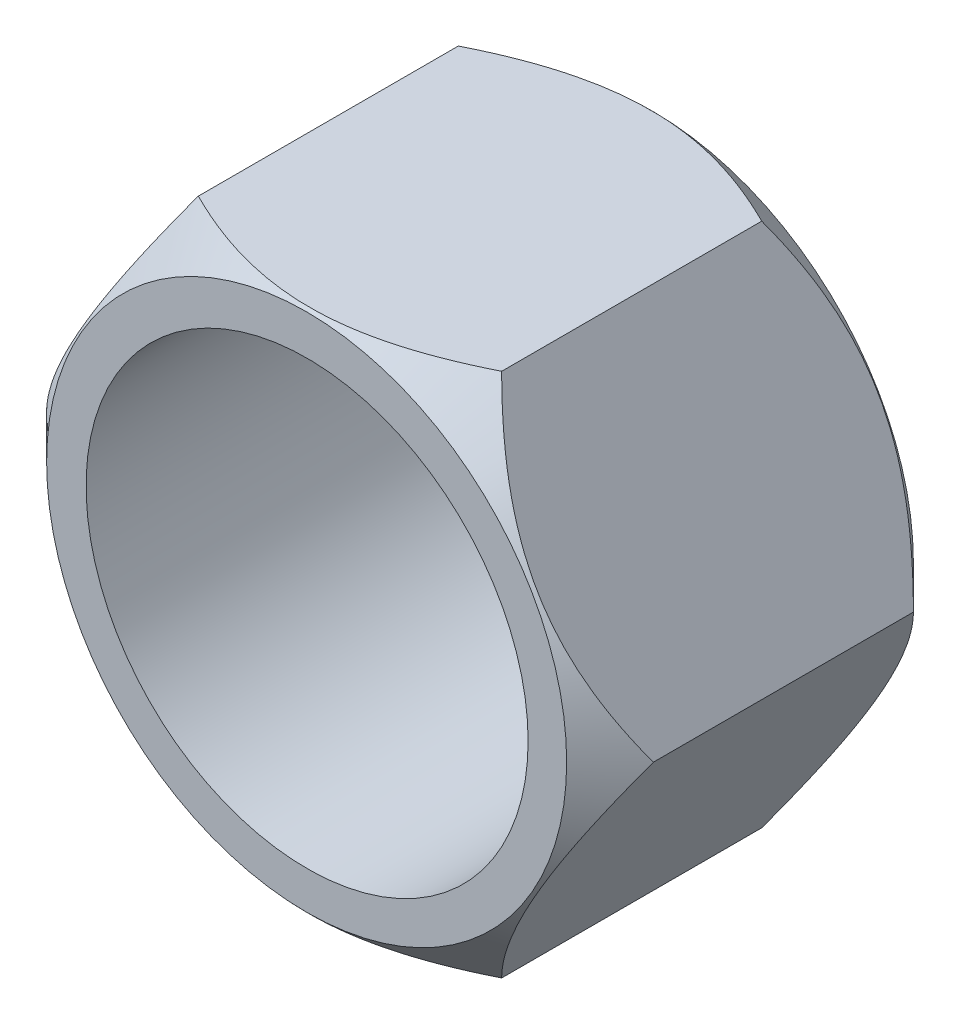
ISO-10303-21;
HEADER;
FILE_DESCRIPTION(('STEP AP214'),'2;1');
FILE_NAME('part.step','',(''),(''),'','','');
FILE_SCHEMA(('AUTOMOTIVE_DESIGN { 1 0 10303 214 1 1 1 1 }'));
ENDSEC;
DATA;
#1=APPLICATION_CONTEXT('core data for automotive mechanical design processes');
#2=APPLICATION_PROTOCOL_DEFINITION('international standard','automotive_design',2000,#1);
#3=PRODUCT_CONTEXT('',#1,'mechanical');
#4=PRODUCT('Part','Part','',(#3));
#5=PRODUCT_RELATED_PRODUCT_CATEGORY('part','',(#4));
#6=PRODUCT_DEFINITION_FORMATION('','',#4);
#7=PRODUCT_DEFINITION_CONTEXT('part definition',#1,'design');
#8=PRODUCT_DEFINITION('design','',#6,#7);
#9=PRODUCT_DEFINITION_SHAPE('','',#8);
#10=(LENGTH_UNIT() NAMED_UNIT(*) SI_UNIT(.MILLI.,.METRE.));
#11=(NAMED_UNIT(*) PLANE_ANGLE_UNIT() SI_UNIT($,.RADIAN.));
#12=(NAMED_UNIT(*) SI_UNIT($,.STERADIAN.) SOLID_ANGLE_UNIT());
#13=UNCERTAINTY_MEASURE_WITH_UNIT(LENGTH_MEASURE(1.E-05),#10,'distance_accuracy_value','');
#14=(GEOMETRIC_REPRESENTATION_CONTEXT(3) GLOBAL_UNCERTAINTY_ASSIGNED_CONTEXT((#13)) GLOBAL_UNIT_ASSIGNED_CONTEXT((#10,
#11,#12)) REPRESENTATION_CONTEXT('',''));
#15=CARTESIAN_POINT('',(0.,0.,0.));
#16=DIRECTION('',(0.,0.,1.));
#17=DIRECTION('',(1.,0.,0.));
#18=AXIS2_PLACEMENT_3D('',#15,#16,#17);
#19=CARTESIAN_POINT('',(0.,0.,3.));
#20=DIRECTION('',(0.,0.,1.));
#21=DIRECTION('',(1.,0.,0.));
#22=AXIS2_PLACEMENT_3D('',#19,#20,#21);
#23=CONICAL_SURFACE('',#22,9.,0.78539816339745);
#24=CARTESIAN_POINT('',(0.,0.,0.));
#25=DIRECTION('',(0.,0.,1.));
#26=DIRECTION('',(1.,0.,0.));
#27=AXIS2_PLACEMENT_3D('',#24,#25,#26);
#28=CIRCLE('',#27,5.99999999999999);
#29=CARTESIAN_POINT('',(5.99999999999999,0.,0.));
#30=VERTEX_POINT('',#29);
#31=EDGE_CURVE('E210',#30,#30,#28,.F.);
#32=ORIENTED_EDGE('',*,*,#31,.F.);
#33=EDGE_LOOP('',(#32));
#34=FACE_BOUND('',#33,.T.);
#35=CARTESIAN_POINT('',(3.49988452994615,6.06237782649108,1.00011547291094));
#36=CARTESIAN_POINT('',(3.56006472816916,5.95814266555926,0.939941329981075));
#37=CARTESIAN_POINT('',(3.62070750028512,5.85310630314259,0.881613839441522));
#38=CARTESIAN_POINT('',(3.74300894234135,5.64127399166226,0.76921390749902));
#39=CARTESIAN_POINT('',(3.80466814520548,5.53447711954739,0.715143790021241));
#40=CARTESIAN_POINT('',(3.99187934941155,5.21021780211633,0.559701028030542));
#41=CARTESIAN_POINT('',(4.1190161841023,4.99001034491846,0.465759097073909));
#42=CARTESIAN_POINT('',(4.37539777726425,4.54594439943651,0.304890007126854));
#43=CARTESIAN_POINT('',(4.5045770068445,4.32219941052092,0.237557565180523));
#44=CARTESIAN_POINT('',(4.70046959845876,3.98290348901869,0.159670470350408));
#45=CARTESIAN_POINT('',(4.76605553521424,3.86930531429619,0.137570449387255));
#46=CARTESIAN_POINT('',(4.89778273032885,3.64114711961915,0.101574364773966));
#47=CARTESIAN_POINT('',(4.96392390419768,3.52658724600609,0.0876770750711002));
#48=CARTESIAN_POINT('',(5.1251007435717,3.24742077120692,0.0643762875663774));
#49=CARTESIAN_POINT('',(5.22031007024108,3.08251338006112,0.0594873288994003));
#50=CARTESIAN_POINT('',(5.41055712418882,2.75299581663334,0.0676930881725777));
#51=CARTESIAN_POINT('',(5.50559477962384,2.58838576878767,0.0807941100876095));
#52=CARTESIAN_POINT('',(5.69477409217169,2.26071758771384,0.124207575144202));
#53=CARTESIAN_POINT('',(5.78891462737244,2.09766139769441,0.154539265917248));
#54=CARTESIAN_POINT('',(5.97557765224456,1.77435155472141,0.230765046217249));
#55=CARTESIAN_POINT('',(6.06810026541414,1.61409768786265,0.276657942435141));
#56=CARTESIAN_POINT('',(6.2323446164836,1.32961812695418,0.371073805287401));
#57=CARTESIAN_POINT('',(6.30443003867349,1.20476251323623,0.417113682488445));
#58=CARTESIAN_POINT('',(6.447306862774,0.957292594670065,0.516612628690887));
#59=CARTESIAN_POINT('',(6.51809822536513,0.834678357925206,0.570071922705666));
#60=CARTESIAN_POINT('',(6.65816396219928,0.592077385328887,0.68321133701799));
#61=CARTESIAN_POINT('',(6.72744231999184,0.472083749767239,0.742871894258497));
#62=CARTESIAN_POINT('',(6.86471619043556,0.23431843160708,0.867630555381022));
#63=CARTESIAN_POINT('',(6.93271245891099,0.116545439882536,0.932725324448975));
#64=CARTESIAN_POINT('',(7.00011547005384,-0.000200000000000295,1.00011547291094));
#65=B_SPLINE_CURVE_WITH_KNOTS('',3,(#35,#36,#37,#38,#39,#40,#41,#42,#43,#44,#45,#46,#47,#48,#49,
#50,#51,#52,#53,#54,#55,#56,#57,#58,#59,#60,#61,#62,#63,#64),.UNSPECIFIED.,.F.,.F.,(4,2,2,2,2,2,
2,2,2,2,2,2,2,2,4),(0.,0.403669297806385,0.807557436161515,1.61969420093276,2.41893497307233,
2.81777152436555,3.21654844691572,3.78710477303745,4.35786108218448,4.92925621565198,
5.50060754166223,5.95442549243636,6.40825720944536,6.8606983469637,7.31286384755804),.UNSPECIFIED.);
#66=CARTESIAN_POINT('',(3.49999999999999,6.06217782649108,1.00000000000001));
#67=VERTEX_POINT('',#66);
#68=CARTESIAN_POINT('',(7.,0.,1.00000000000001));
#69=VERTEX_POINT('',#68);
#70=EDGE_CURVE('E87',#67,#69,#65,.T.);
#71=ORIENTED_EDGE('',*,*,#70,.T.);
#72=CARTESIAN_POINT('',(7.00011547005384,0.0002,1.00011547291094));
#73=CARTESIAN_POINT('',(6.93993527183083,-0.104035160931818,0.939941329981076));
#74=CARTESIAN_POINT('',(6.87929249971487,-0.209071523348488,0.881613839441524));
#75=CARTESIAN_POINT('',(6.75699105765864,-0.42090383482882,0.769213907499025));
#76=CARTESIAN_POINT('',(6.69533185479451,-0.527700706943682,0.715143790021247));
#77=CARTESIAN_POINT('',(6.50812065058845,-0.851960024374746,0.559701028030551));
#78=CARTESIAN_POINT('',(6.3809838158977,-1.07216748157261,0.465759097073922));
#79=CARTESIAN_POINT('',(6.12460222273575,-1.51623342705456,0.304890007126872));
#80=CARTESIAN_POINT('',(5.99542299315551,-1.73997841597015,0.237557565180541));
#81=CARTESIAN_POINT('',(5.79953040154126,-2.07927433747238,0.159670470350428));
#82=CARTESIAN_POINT('',(5.73394446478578,-2.19287251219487,0.137570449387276));
#83=CARTESIAN_POINT('',(5.60221726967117,-2.42103070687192,0.10157436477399));
#84=CARTESIAN_POINT('',(5.53607609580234,-2.53559058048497,0.0876770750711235));
#85=CARTESIAN_POINT('',(5.37489925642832,-2.81475705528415,0.0643762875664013));
#86=CARTESIAN_POINT('',(5.27968992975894,-2.97966444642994,0.059487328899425));
#87=CARTESIAN_POINT('',(5.0894428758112,-3.30918200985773,0.0676930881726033));
#88=CARTESIAN_POINT('',(4.99440522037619,-3.4737920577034,0.0807941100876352));
#89=CARTESIAN_POINT('',(4.80522590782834,-3.80146023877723,0.124207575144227));
#90=CARTESIAN_POINT('',(4.71108537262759,-3.96451642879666,0.154539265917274));
#91=CARTESIAN_POINT('',(4.52442234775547,-4.28782627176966,0.230765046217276));
#92=CARTESIAN_POINT('',(4.43189973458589,-4.44808013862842,0.276657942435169));
#93=CARTESIAN_POINT('',(4.26765538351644,-4.73255969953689,0.371073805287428));
#94=CARTESIAN_POINT('',(4.19556996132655,-4.85741531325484,0.41711368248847));
#95=CARTESIAN_POINT('',(4.05269313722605,-5.10488523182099,0.516612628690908));
#96=CARTESIAN_POINT('',(3.98190177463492,-5.22749946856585,0.570071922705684));
#97=CARTESIAN_POINT('',(3.84183603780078,-5.47010044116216,0.683211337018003));
#98=CARTESIAN_POINT('',(3.77255768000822,-5.5900940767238,0.742871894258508));
#99=CARTESIAN_POINT('',(3.63528380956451,-5.82785939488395,0.867630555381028));
#100=CARTESIAN_POINT('',(3.56728754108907,-5.9456323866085,0.932725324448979));
#101=CARTESIAN_POINT('',(3.49988452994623,-6.06237782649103,1.00011547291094));
#102=B_SPLINE_CURVE_WITH_KNOTS('',3,(#72,#73,#74,#75,#76,#77,#78,#79,#80,#81,#82,#83,#84,#85,
#86,#87,#88,#89,#90,#91,#92,#93,#94,#95,#96,#97,#98,#99,#100,#101),.UNSPECIFIED.,.F.,.F.,(4,2,2,
2,2,2,2,2,2,2,2,2,2,2,4),(0.,0.403669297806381,0.807557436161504,1.61969420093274,
2.4189349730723,2.81777152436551,3.21654844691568,3.78710477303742,4.35786108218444,
4.92925621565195,5.5006075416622,5.95442549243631,6.40825720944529,6.86069834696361,
7.31286384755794),.UNSPECIFIED.);
#103=CARTESIAN_POINT('',(3.50000000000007,-6.06217782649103,1.00000000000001));
#104=VERTEX_POINT('',#103);
#105=EDGE_CURVE('E176',#69,#104,#102,.T.);
#106=ORIENTED_EDGE('',*,*,#105,.T.);
#107=CARTESIAN_POINT('',(-7.4821683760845,-6.06217782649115,3.62978938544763));
#108=CARTESIAN_POINT('',(-7.30206749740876,-6.06217782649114,3.48988550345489));
#109=CARTESIAN_POINT('',(-7.12101670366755,-6.06217782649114,3.35118561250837));
#110=CARTESIAN_POINT('',(-6.75661990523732,-6.06217782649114,3.07674964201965));
#111=CARTESIAN_POINT('',(-6.57327338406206,-6.06217782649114,2.94101424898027));
#112=CARTESIAN_POINT('',(-6.20255269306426,-6.06217782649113,2.67209823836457));
#113=CARTESIAN_POINT('',(-6.01515839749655,-6.06217782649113,2.53894527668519));
#114=CARTESIAN_POINT('',(-5.63728718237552,-6.06217782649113,2.27710324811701));
#115=CARTESIAN_POINT('',(-5.44681047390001,-6.06217782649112,2.14841387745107));
#116=CARTESIAN_POINT('',(-5.04937814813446,-6.06217782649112,1.88810316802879));
#117=CARTESIAN_POINT('',(-4.84217255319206,-6.06217782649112,1.75686158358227));
#118=CARTESIAN_POINT('',(-4.42288563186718,-6.06217782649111,1.50227676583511));
#119=CARTESIAN_POINT('',(-4.21080346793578,-6.06217782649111,1.37893490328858));
#120=CARTESIAN_POINT('',(-3.78166384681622,-6.06217782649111,1.14275692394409));
#121=CARTESIAN_POINT('',(-3.56462346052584,-6.0621778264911,1.02989003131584));
#122=CARTESIAN_POINT('',(-3.12429710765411,-6.0621778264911,0.817191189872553));
#123=CARTESIAN_POINT('',(-2.90101421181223,-6.0621778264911,0.717352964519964));
#124=CARTESIAN_POINT('',(-2.47206356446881,-6.06217782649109,0.544225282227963));
#125=CARTESIAN_POINT('',(-2.26708951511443,-6.06217782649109,0.469234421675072));
#126=CARTESIAN_POINT('',(-1.85176699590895,-6.06217782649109,0.335646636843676));
#127=CARTESIAN_POINT('',(-1.64141819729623,-6.06217782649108,0.277050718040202));
#128=CARTESIAN_POINT('',(-1.22035981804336,-6.06217782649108,0.180467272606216));
#129=CARTESIAN_POINT('',(-1.00974034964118,-6.06217782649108,0.142093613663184));
#130=CARTESIAN_POINT('',(-0.585689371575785,-6.06217782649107,0.0867818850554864));
#131=CARTESIAN_POINT('',(-0.372258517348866,-6.06217782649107,0.0698389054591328));
#132=CARTESIAN_POINT('',(0.0449016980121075,-6.06217782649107,0.0589309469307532));
#133=CARTESIAN_POINT('',(0.248603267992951,-6.06217782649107,0.0638986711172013));
#134=CARTESIAN_POINT('',(0.654494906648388,-6.06217782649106,0.0940446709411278));
#135=CARTESIAN_POINT('',(0.856684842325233,-6.06217782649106,0.11922470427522));
#136=CARTESIAN_POINT('',(1.26152367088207,-6.06217782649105,0.188772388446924));
#137=CARTESIAN_POINT('',(1.46411214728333,-6.06217782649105,0.233485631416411));
#138=CARTESIAN_POINT('',(1.86479717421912,-6.06217782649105,0.339566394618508));
#139=CARTESIAN_POINT('',(2.06289391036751,-6.06217782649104,0.400933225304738));
#140=CARTESIAN_POINT('',(2.46214896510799,-6.06217782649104,0.54031691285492));
#141=CARTESIAN_POINT('',(2.66310376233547,-6.06217782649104,0.618909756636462));
#142=CARTESIAN_POINT('',(3.05986341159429,-6.06217782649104,0.788265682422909));
#143=CARTESIAN_POINT('',(3.25566592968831,-6.06217782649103,0.879034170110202));
#144=CARTESIAN_POINT('',(3.64303244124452,-6.06217782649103,1.07059087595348));
#145=CARTESIAN_POINT('',(3.83458119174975,-6.06217782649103,1.17140966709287));
#146=CARTESIAN_POINT('',(4.21329670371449,-6.06217782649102,1.38085265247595));
#147=CARTESIAN_POINT('',(4.40046412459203,-6.06217782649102,1.48947566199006));
#148=CARTESIAN_POINT('',(4.76185682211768,-6.06217782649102,1.70750006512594));
#149=CARTESIAN_POINT('',(4.93626535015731,-6.06217782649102,1.81659931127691));
#150=CARTESIAN_POINT('',(5.28208532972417,-6.06217782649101,2.0394623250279));
#151=CARTESIAN_POINT('',(5.45349655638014,-6.06217782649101,2.15322644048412));
#152=CARTESIAN_POINT('',(5.79234143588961,-6.06217782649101,2.38366781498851));
#153=CARTESIAN_POINT('',(5.95979592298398,-6.062177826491,2.5003145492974));
#154=CARTESIAN_POINT('',(6.29240454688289,-6.062177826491,2.73675063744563));
#155=CARTESIAN_POINT('',(6.45755930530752,-6.062177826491,2.85653911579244));
#156=CARTESIAN_POINT('',(6.62174871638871,-6.062177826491,2.9776141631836));
#157=B_SPLINE_CURVE_WITH_KNOTS('',3,(#107,#108,#109,#110,#111,#112,#113,#114,#115,#116,#117,
#118,#119,#120,#121,#122,#123,#124,#125,#126,#127,#128,#129,#130,#131,#132,#133,#134,#135,#136,
#137,#138,#139,#140,#141,#142,#143,#144,#145,#146,#147,#148,#149,#150,#151,#152,#153,#154,#155,
#156),.UNSPECIFIED.,.F.,.F.,(4,2,2,2,2,2,2,2,2,2,2,2,2,2,2,2,2,2,2,2,2,2,2,2,4),(0.,
0.684179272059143,1.36851533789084,2.05811141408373,2.74766046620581,3.48333743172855,
4.21914170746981,4.95271077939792,5.68592514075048,6.34014994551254,6.99441486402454,
7.63568747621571,8.27681314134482,8.8870629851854,9.49736590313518,10.1189339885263,
10.7404763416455,11.3873146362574,12.0344410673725,12.683599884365,13.3326603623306,
13.9497353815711,14.5668564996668,15.1790486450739,15.7910719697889),.UNSPECIFIED.);
#158=CARTESIAN_POINT('',(-3.49999999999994,-6.0621778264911,1.00000000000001));
#159=VERTEX_POINT('',#158);
#160=EDGE_CURVE('E170',#104,#159,#157,.F.);
#161=ORIENTED_EDGE('',*,*,#160,.T.);
#162=CARTESIAN_POINT('',(-3.4998845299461,-6.0623778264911,1.00011547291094));
#163=CARTESIAN_POINT('',(-3.56006472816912,-5.95814266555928,0.939941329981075));
#164=CARTESIAN_POINT('',(-3.62070750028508,-5.85310630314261,0.881613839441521));
#165=CARTESIAN_POINT('',(-3.74300894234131,-5.64127399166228,0.769213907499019));
#166=CARTESIAN_POINT('',(-3.80466814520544,-5.53447711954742,0.71514379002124));
#167=CARTESIAN_POINT('',(-3.99187934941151,-5.21021780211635,0.559701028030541));
#168=CARTESIAN_POINT('',(-4.11901618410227,-4.99001034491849,0.465759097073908));
#169=CARTESIAN_POINT('',(-4.37539777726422,-4.54594439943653,0.304890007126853));
#170=CARTESIAN_POINT('',(-4.50457700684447,-4.32219941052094,0.237557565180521));
#171=CARTESIAN_POINT('',(-4.70046959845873,-3.98290348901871,0.159670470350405));
#172=CARTESIAN_POINT('',(-4.76605553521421,-3.86930531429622,0.137570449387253));
#173=CARTESIAN_POINT('',(-4.89778273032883,-3.64114711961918,0.101574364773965));
#174=CARTESIAN_POINT('',(-4.96392390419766,-3.52658724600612,0.0876770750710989));
#175=CARTESIAN_POINT('',(-5.12510074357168,-3.24742077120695,0.0643762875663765));
#176=CARTESIAN_POINT('',(-5.22031007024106,-3.08251338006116,0.0594873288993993));
#177=CARTESIAN_POINT('',(-5.41055712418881,-2.75299581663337,0.0676930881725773));
#178=CARTESIAN_POINT('',(-5.50559477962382,-2.5883857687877,0.0807941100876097));
#179=CARTESIAN_POINT('',(-5.69477409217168,-2.26071758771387,0.124207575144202));
#180=CARTESIAN_POINT('',(-5.78891462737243,-2.09766139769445,0.154539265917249));
#181=CARTESIAN_POINT('',(-5.97557765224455,-1.77435155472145,0.230765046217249));
#182=CARTESIAN_POINT('',(-6.06810026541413,-1.61409768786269,0.276657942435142));
#183=CARTESIAN_POINT('',(-6.23234461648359,-1.32961812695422,0.371073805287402));
#184=CARTESIAN_POINT('',(-6.30443003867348,-1.20476251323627,0.417113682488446));
#185=CARTESIAN_POINT('',(-6.447306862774,-0.957292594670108,0.516612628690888));
#186=CARTESIAN_POINT('',(-6.51809822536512,-0.834678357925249,0.570071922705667));
#187=CARTESIAN_POINT('',(-6.65816396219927,-0.592077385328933,0.683211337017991));
#188=CARTESIAN_POINT('',(-6.72744231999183,-0.472083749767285,0.742871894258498));
#189=CARTESIAN_POINT('',(-6.86471619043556,-0.234318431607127,0.867630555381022));
#190=CARTESIAN_POINT('',(-6.93271245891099,-0.116545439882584,0.932725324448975));
#191=CARTESIAN_POINT('',(-7.00011547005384,0.000199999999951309,1.00011547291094));
#192=B_SPLINE_CURVE_WITH_KNOTS('',3,(#162,#163,#164,#165,#166,#167,#168,#169,#170,#171,#172,
#173,#174,#175,#176,#177,#178,#179,#180,#181,#182,#183,#184,#185,#186,#187,#188,#189,#190,#191),
.UNSPECIFIED.,.F.,.F.,(4,2,2,2,2,2,2,2,2,2,2,2,2,2,4),(0.,0.403669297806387,0.807557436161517,
1.61969420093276,2.41893497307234,2.81777152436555,3.21654844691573,3.78710477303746,
4.35786108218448,4.92925621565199,5.50060754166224,5.95442549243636,6.40825720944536,
6.8606983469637,7.31286384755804),.UNSPECIFIED.);
#193=CARTESIAN_POINT('',(-7.,0.,1.00000000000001));
#194=VERTEX_POINT('',#193);
#195=EDGE_CURVE('E108',#159,#194,#192,.T.);
#196=ORIENTED_EDGE('',*,*,#195,.T.);
#197=CARTESIAN_POINT('',(-7.00011547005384,-0.000200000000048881,1.00011547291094));
#198=CARTESIAN_POINT('',(-6.93993527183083,0.104035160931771,0.939941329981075));
#199=CARTESIAN_POINT('',(-6.87929249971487,0.209071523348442,0.881613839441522));
#200=CARTESIAN_POINT('',(-6.75699105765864,0.420903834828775,0.769213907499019));
#201=CARTESIAN_POINT('',(-6.69533185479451,0.527700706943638,0.71514379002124));
#202=CARTESIAN_POINT('',(-6.50812065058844,0.851960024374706,0.55970102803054));
#203=CARTESIAN_POINT('',(-6.38098381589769,1.07216748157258,0.465759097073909));
#204=CARTESIAN_POINT('',(-6.12460222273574,1.51623342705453,0.304890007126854));
#205=CARTESIAN_POINT('',(-5.9954229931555,1.73997841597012,0.237557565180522));
#206=CARTESIAN_POINT('',(-5.79953040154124,2.07927433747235,0.159670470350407));
#207=CARTESIAN_POINT('',(-5.73394446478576,2.19287251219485,0.137570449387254));
#208=CARTESIAN_POINT('',(-5.60221726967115,2.4210307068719,0.101574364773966));
#209=CARTESIAN_POINT('',(-5.53607609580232,2.53559058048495,0.0876770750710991));
#210=CARTESIAN_POINT('',(-5.3748992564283,2.81475705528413,0.0643762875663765));
#211=CARTESIAN_POINT('',(-5.27968992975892,2.97966444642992,0.0594873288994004));
#212=CARTESIAN_POINT('',(-5.08944287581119,3.3091820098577,0.0676930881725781));
#213=CARTESIAN_POINT('',(-4.99440522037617,3.47379205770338,0.0807941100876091));
#214=CARTESIAN_POINT('',(-4.80522590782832,3.80146023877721,0.124207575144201));
#215=CARTESIAN_POINT('',(-4.71108537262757,3.96451642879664,0.154539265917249));
#216=CARTESIAN_POINT('',(-4.52442234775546,4.28782627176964,0.23076504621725));
#217=CARTESIAN_POINT('',(-4.43189973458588,4.44808013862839,0.276657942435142));
#218=CARTESIAN_POINT('',(-4.26765538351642,4.73255969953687,0.371073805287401));
#219=CARTESIAN_POINT('',(-4.19556996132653,4.85741531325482,0.417113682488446));
#220=CARTESIAN_POINT('',(-4.05269313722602,5.10488523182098,0.516612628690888));
#221=CARTESIAN_POINT('',(-3.9819017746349,5.22749946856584,0.570071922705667));
#222=CARTESIAN_POINT('',(-3.84183603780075,5.47010044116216,0.68321133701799));
#223=CARTESIAN_POINT('',(-3.77255768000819,5.59009407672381,0.742871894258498));
#224=CARTESIAN_POINT('',(-3.63528380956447,5.82785939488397,0.867630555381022));
#225=CARTESIAN_POINT('',(-3.56728754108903,5.94563238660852,0.932725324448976));
#226=CARTESIAN_POINT('',(-3.49988452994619,6.06237782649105,1.00011547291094));
#227=B_SPLINE_CURVE_WITH_KNOTS('',3,(#197,#198,#199,#200,#201,#202,#203,#204,#205,#206,#207,
#208,#209,#210,#211,#212,#213,#214,#215,#216,#217,#218,#219,#220,#221,#222,#223,#224,#225,#226),
.UNSPECIFIED.,.F.,.F.,(4,2,2,2,2,2,2,2,2,2,2,2,2,2,4),(0.,0.403669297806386,0.807557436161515,
1.61969420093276,2.41893497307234,2.81777152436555,3.21654844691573,3.78710477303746,
4.35786108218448,4.92925621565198,5.50060754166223,5.95442549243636,6.40825720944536,
6.8606983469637,7.31286384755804),.UNSPECIFIED.);
#228=CARTESIAN_POINT('',(-3.50000000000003,6.06217782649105,1.00000000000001));
#229=VERTEX_POINT('',#228);
#230=EDGE_CURVE('E106',#194,#229,#227,.T.);
#231=ORIENTED_EDGE('',*,*,#230,.T.);
#232=CARTESIAN_POINT('',(-7.48216837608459,6.06217782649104,3.62978938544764));
#233=CARTESIAN_POINT('',(-7.30206749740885,6.06217782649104,3.48988550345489));
#234=CARTESIAN_POINT('',(-7.12101670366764,6.06217782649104,3.35118561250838));
#235=CARTESIAN_POINT('',(-6.75661990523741,6.06217782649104,3.07674964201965));
#236=CARTESIAN_POINT('',(-6.57327338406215,6.06217782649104,2.94101424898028));
#237=CARTESIAN_POINT('',(-6.20255269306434,6.06217782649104,2.67209823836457));
#238=CARTESIAN_POINT('',(-6.01515839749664,6.06217782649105,2.53894527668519));
#239=CARTESIAN_POINT('',(-5.63728718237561,6.06217782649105,2.27710324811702));
#240=CARTESIAN_POINT('',(-5.4468104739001,6.06217782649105,2.14841387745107));
#241=CARTESIAN_POINT('',(-5.04937814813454,6.06217782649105,1.88810316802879));
#242=CARTESIAN_POINT('',(-4.84217255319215,6.06217782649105,1.75686158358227));
#243=CARTESIAN_POINT('',(-4.42288563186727,6.06217782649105,1.50227676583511));
#244=CARTESIAN_POINT('',(-4.21080346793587,6.06217782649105,1.37893490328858));
#245=CARTESIAN_POINT('',(-3.78166384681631,6.06217782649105,1.14275692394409));
#246=CARTESIAN_POINT('',(-3.56462346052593,6.06217782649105,1.02989003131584));
#247=CARTESIAN_POINT('',(-3.1242971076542,6.06217782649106,0.817191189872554));
#248=CARTESIAN_POINT('',(-2.90101421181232,6.06217782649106,0.717352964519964));
#249=CARTESIAN_POINT('',(-2.4720635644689,6.06217782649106,0.544225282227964));
#250=CARTESIAN_POINT('',(-2.26708951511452,6.06217782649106,0.469234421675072));
#251=CARTESIAN_POINT('',(-1.85176699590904,6.06217782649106,0.335646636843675));
#252=CARTESIAN_POINT('',(-1.64141819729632,6.06217782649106,0.277050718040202));
#253=CARTESIAN_POINT('',(-1.22035981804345,6.06217782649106,0.180467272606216));
#254=CARTESIAN_POINT('',(-1.00974034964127,6.06217782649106,0.142093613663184));
#255=CARTESIAN_POINT('',(-0.585689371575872,6.06217782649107,0.086781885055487));
#256=CARTESIAN_POINT('',(-0.372258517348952,6.06217782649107,0.0698389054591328));
#257=CARTESIAN_POINT('',(0.0449016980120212,6.06217782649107,0.0589309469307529));
#258=CARTESIAN_POINT('',(0.248603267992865,6.06217782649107,0.0638986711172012));
#259=CARTESIAN_POINT('',(0.654494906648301,6.06217782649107,0.0940446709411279));
#260=CARTESIAN_POINT('',(0.856684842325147,6.06217782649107,0.11922470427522));
#261=CARTESIAN_POINT('',(1.26152367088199,6.06217782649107,0.188772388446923));
#262=CARTESIAN_POINT('',(1.46411214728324,6.06217782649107,0.233485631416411));
#263=CARTESIAN_POINT('',(1.86479717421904,6.06217782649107,0.339566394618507));
#264=CARTESIAN_POINT('',(2.06289391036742,6.06217782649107,0.400933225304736));
#265=CARTESIAN_POINT('',(2.46214896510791,6.06217782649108,0.540316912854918));
#266=CARTESIAN_POINT('',(2.66310376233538,6.06217782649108,0.618909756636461));
#267=CARTESIAN_POINT('',(3.0598634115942,6.06217782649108,0.788265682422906));
#268=CARTESIAN_POINT('',(3.25566592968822,6.06217782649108,0.879034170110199));
#269=CARTESIAN_POINT('',(3.64303244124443,6.06217782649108,1.07059087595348));
#270=CARTESIAN_POINT('',(3.83458119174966,6.06217782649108,1.17140966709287));
#271=CARTESIAN_POINT('',(4.2132967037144,6.06217782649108,1.38085265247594));
#272=CARTESIAN_POINT('',(4.40046412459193,6.06217782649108,1.48947566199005));
#273=CARTESIAN_POINT('',(4.76185682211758,6.06217782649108,1.70750006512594));
#274=CARTESIAN_POINT('',(4.93626535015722,6.06217782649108,1.81659931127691));
#275=CARTESIAN_POINT('',(5.28208532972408,6.06217782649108,2.03946232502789));
#276=CARTESIAN_POINT('',(5.45349655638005,6.06217782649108,2.15322644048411));
#277=CARTESIAN_POINT('',(5.79234143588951,6.06217782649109,2.38366781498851));
#278=CARTESIAN_POINT('',(5.95979592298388,6.06217782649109,2.50031454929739));
#279=CARTESIAN_POINT('',(6.2924045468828,6.06217782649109,2.73675063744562));
#280=CARTESIAN_POINT('',(6.45755930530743,6.06217782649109,2.85653911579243));
#281=CARTESIAN_POINT('',(6.62174871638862,6.06217782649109,2.97761416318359));
#282=B_SPLINE_CURVE_WITH_KNOTS('',3,(#232,#233,#234,#235,#236,#237,#238,#239,#240,#241,#242,
#243,#244,#245,#246,#247,#248,#249,#250,#251,#252,#253,#254,#255,#256,#257,#258,#259,#260,#261,
#262,#263,#264,#265,#266,#267,#268,#269,#270,#271,#272,#273,#274,#275,#276,#277,#278,#279,#280,
#281),.UNSPECIFIED.,.F.,.F.,(4,2,2,2,2,2,2,2,2,2,2,2,2,2,2,2,2,2,2,2,2,2,2,2,4),(0.,
0.684179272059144,1.36851533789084,2.05811141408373,2.74766046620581,3.48333743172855,
4.21914170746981,4.95271077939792,5.68592514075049,6.34014994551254,6.99441486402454,
7.63568747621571,8.27681314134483,8.88706298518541,9.49736590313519,10.1189339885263,
10.7404763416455,11.3873146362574,12.0344410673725,12.683599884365,13.3326603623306,
13.9497353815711,14.5668564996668,15.1790486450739,15.7910719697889),.UNSPECIFIED.);
#283=EDGE_CURVE('E92',#229,#67,#282,.T.);
#284=ORIENTED_EDGE('',*,*,#283,.T.);
#285=EDGE_LOOP('',(#71,#106,#161,#196,#231,#284));
#286=FACE_BOUND('',#285,.T.);
#287=ADVANCED_FACE('F32',(#34,#286),#23,.T.);
#288=CARTESIAN_POINT('',(0.,0.,8.));
#289=DIRECTION('',(0.,0.,-1.));
#290=DIRECTION('',(-1.,0.,0.));
#291=AXIS2_PLACEMENT_3D('',#288,#289,#290);
#292=CONICAL_SURFACE('',#291,6.00000000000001,0.785398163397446);
#293=CARTESIAN_POINT('',(0.,0.,8.));
#294=DIRECTION('',(0.,0.,1.));
#295=DIRECTION('',(1.,0.,0.));
#296=AXIS2_PLACEMENT_3D('',#293,#294,#295);
#297=CIRCLE('',#296,6.00000000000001);
#298=CARTESIAN_POINT('',(6.00000000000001,0.,8.));
#299=VERTEX_POINT('',#298);
#300=EDGE_CURVE('E211',#299,#299,#297,.T.);
#301=ORIENTED_EDGE('',*,*,#300,.F.);
#302=EDGE_LOOP('',(#301));
#303=FACE_BOUND('',#302,.T.);
#304=CARTESIAN_POINT('',(-7.48216837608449,-6.06217782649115,4.37021061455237));
#305=CARTESIAN_POINT('',(-7.30206749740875,-6.06217782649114,4.51011449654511));
#306=CARTESIAN_POINT('',(-7.12101670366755,-6.06217782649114,4.64881438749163));
#307=CARTESIAN_POINT('',(-6.75661990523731,-6.06217782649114,4.92325035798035));
#308=CARTESIAN_POINT('',(-6.57327338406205,-6.06217782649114,5.05898575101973));
#309=CARTESIAN_POINT('',(-6.20255269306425,-6.06217782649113,5.32790176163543));
#310=CARTESIAN_POINT('',(-6.01515839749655,-6.06217782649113,5.46105472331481));
#311=CARTESIAN_POINT('',(-5.63728718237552,-6.06217782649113,5.72289675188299));
#312=CARTESIAN_POINT('',(-5.44681047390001,-6.06217782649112,5.85158612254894));
#313=CARTESIAN_POINT('',(-5.04937814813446,-6.06217782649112,6.11189683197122));
#314=CARTESIAN_POINT('',(-4.84217255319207,-6.06217782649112,6.24313841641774));
#315=CARTESIAN_POINT('',(-4.42288563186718,-6.06217782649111,6.4977232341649));
#316=CARTESIAN_POINT('',(-4.21080346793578,-6.06217782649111,6.62106509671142));
#317=CARTESIAN_POINT('',(-3.78166384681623,-6.06217782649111,6.85724307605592));
#318=CARTESIAN_POINT('',(-3.56462346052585,-6.0621778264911,6.97010996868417));
#319=CARTESIAN_POINT('',(-3.12429710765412,-6.0621778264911,7.18280881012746));
#320=CARTESIAN_POINT('',(-2.90101421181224,-6.0621778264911,7.28264703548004));
#321=CARTESIAN_POINT('',(-2.47206356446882,-6.06217782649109,7.45577471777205));
#322=CARTESIAN_POINT('',(-2.26708951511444,-6.06217782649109,7.53076557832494));
#323=CARTESIAN_POINT('',(-1.85176699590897,-6.06217782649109,7.66435336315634));
#324=CARTESIAN_POINT('',(-1.64141819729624,-6.06217782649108,7.72294928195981));
#325=CARTESIAN_POINT('',(-1.22035981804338,-6.06217782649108,7.8195327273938));
#326=CARTESIAN_POINT('',(-1.0097403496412,-6.06217782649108,7.85790638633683));
#327=CARTESIAN_POINT('',(-0.585689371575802,-6.06217782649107,7.91321811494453));
#328=CARTESIAN_POINT('',(-0.372258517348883,-6.06217782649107,7.93016109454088));
#329=CARTESIAN_POINT('',(0.0449016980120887,-6.06217782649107,7.94106905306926));
#330=CARTESIAN_POINT('',(0.248603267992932,-6.06217782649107,7.93610132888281));
#331=CARTESIAN_POINT('',(0.654494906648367,-6.06217782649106,7.90595532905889));
#332=CARTESIAN_POINT('',(0.856684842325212,-6.06217782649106,7.8807752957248));
#333=CARTESIAN_POINT('',(1.26152367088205,-6.06217782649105,7.8112276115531));
#334=CARTESIAN_POINT('',(1.4641121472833,-6.06217782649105,7.76651436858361));
#335=CARTESIAN_POINT('',(1.8647971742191,-6.06217782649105,7.66043360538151));
#336=CARTESIAN_POINT('',(2.06289391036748,-6.06217782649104,7.59906677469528));
#337=CARTESIAN_POINT('',(2.46214896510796,-6.06217782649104,7.4596830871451));
#338=CARTESIAN_POINT('',(2.66310376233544,-6.06217782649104,7.38109024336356));
#339=CARTESIAN_POINT('',(3.05986341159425,-6.06217782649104,7.21173431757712));
#340=CARTESIAN_POINT('',(3.25566592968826,-6.06217782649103,7.12096582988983));
#341=CARTESIAN_POINT('',(3.64303244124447,-6.06217782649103,6.92940912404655));
#342=CARTESIAN_POINT('',(3.83458119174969,-6.06217782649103,6.82859033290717));
#343=CARTESIAN_POINT('',(4.21329670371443,-6.06217782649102,6.6191473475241));
#344=CARTESIAN_POINT('',(4.40046412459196,-6.06217782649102,6.51052433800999));
#345=CARTESIAN_POINT('',(4.7618568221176,-6.06217782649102,6.29249993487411));
#346=CARTESIAN_POINT('',(4.93626535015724,-6.06217782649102,6.18340068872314));
#347=CARTESIAN_POINT('',(5.28208532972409,-6.06217782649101,5.96053767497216));
#348=CARTESIAN_POINT('',(5.45349655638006,-6.06217782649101,5.84677355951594));
#349=CARTESIAN_POINT('',(5.79234143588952,-6.06217782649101,5.61633218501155));
#350=CARTESIAN_POINT('',(5.95979592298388,-6.062177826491,5.49968545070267));
#351=CARTESIAN_POINT('',(6.29240454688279,-6.062177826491,5.26324936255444));
#352=CARTESIAN_POINT('',(6.45755930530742,-6.062177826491,5.14346088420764));
#353=CARTESIAN_POINT('',(6.6217487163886,-6.062177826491,5.02238583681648));
#354=B_SPLINE_CURVE_WITH_KNOTS('',3,(#304,#305,#306,#307,#308,#309,#310,#311,#312,#313,#314,
#315,#316,#317,#318,#319,#320,#321,#322,#323,#324,#325,#326,#327,#328,#329,#330,#331,#332,#333,
#334,#335,#336,#337,#338,#339,#340,#341,#342,#343,#344,#345,#346,#347,#348,#349,#350,#351,#352,
#353),.UNSPECIFIED.,.F.,.F.,(4,2,2,2,2,2,2,2,2,2,2,2,2,2,2,2,2,2,2,2,2,2,2,2,4),(0.,
0.684179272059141,1.36851533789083,2.05811141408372,2.7476604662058,3.48333743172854,
4.2191417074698,4.95271077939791,5.68592514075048,6.34014994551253,6.99441486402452,
7.63568747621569,8.2768131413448,8.88706298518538,9.49736590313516,10.1189339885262,
10.7404763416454,11.3873146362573,12.0344410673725,12.6835998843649,13.3326603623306,
13.949735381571,14.5668564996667,15.1790486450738,15.7910719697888),.UNSPECIFIED.);
#355=CARTESIAN_POINT('',(-3.49999999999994,-6.0621778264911,7.));
#356=VERTEX_POINT('',#355);
#357=CARTESIAN_POINT('',(3.50000000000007,-6.06217782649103,7.));
#358=VERTEX_POINT('',#357);
#359=EDGE_CURVE('E45',#356,#358,#354,.T.);
#360=ORIENTED_EDGE('',*,*,#359,.T.);
#361=CARTESIAN_POINT('',(3.49988452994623,-6.06237782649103,6.99988452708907));
#362=CARTESIAN_POINT('',(3.56006472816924,-5.95814266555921,7.06005867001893));
#363=CARTESIAN_POINT('',(3.6207075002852,-5.85310630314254,7.11838616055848));
#364=CARTESIAN_POINT('',(3.74300894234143,-5.64127399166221,7.23078609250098));
#365=CARTESIAN_POINT('',(3.80466814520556,-5.53447711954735,7.28485620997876));
#366=CARTESIAN_POINT('',(3.99187934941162,-5.21021780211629,7.44029897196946));
#367=CARTESIAN_POINT('',(4.11901618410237,-4.99001034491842,7.53424090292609));
#368=CARTESIAN_POINT('',(4.37539777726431,-4.54594439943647,7.69510999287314));
#369=CARTESIAN_POINT('',(4.50457700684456,-4.32219941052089,7.76244243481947));
#370=CARTESIAN_POINT('',(4.70046959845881,-3.98290348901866,7.84032952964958));
#371=CARTESIAN_POINT('',(4.76605553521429,-3.86930531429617,7.86242955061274));
#372=CARTESIAN_POINT('',(4.8977827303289,-3.64114711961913,7.89842563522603));
#373=CARTESIAN_POINT('',(4.96392390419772,-3.52658724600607,7.91232292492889));
#374=CARTESIAN_POINT('',(5.12510074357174,-3.2474207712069,7.93562371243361));
#375=CARTESIAN_POINT('',(5.22031007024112,-3.08251338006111,7.94051267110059));
#376=CARTESIAN_POINT('',(5.41055712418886,-2.75299581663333,7.93230691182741));
#377=CARTESIAN_POINT('',(5.50559477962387,-2.58838576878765,7.91920588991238));
#378=CARTESIAN_POINT('',(5.69477409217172,-2.26071758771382,7.87579242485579));
#379=CARTESIAN_POINT('',(5.78891462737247,-2.0976613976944,7.84546073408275));
#380=CARTESIAN_POINT('',(5.97557765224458,-1.7743515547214,7.76923495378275));
#381=CARTESIAN_POINT('',(6.06810026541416,-1.61409768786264,7.72334205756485));
#382=CARTESIAN_POINT('',(6.23234461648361,-1.32961812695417,7.6289261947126));
#383=CARTESIAN_POINT('',(6.30443003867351,-1.20476251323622,7.58288631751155));
#384=CARTESIAN_POINT('',(6.44730686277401,-0.957292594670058,7.48338737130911));
#385=CARTESIAN_POINT('',(6.51809822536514,-0.834678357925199,7.42992807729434));
#386=CARTESIAN_POINT('',(6.65816396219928,-0.592077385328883,7.31678866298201));
#387=CARTESIAN_POINT('',(6.72744231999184,-0.472083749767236,7.25712810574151));
#388=CARTESIAN_POINT('',(6.86471619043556,-0.234318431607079,7.13236944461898));
#389=CARTESIAN_POINT('',(6.932712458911,-0.116545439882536,7.06727467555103));
#390=CARTESIAN_POINT('',(7.00011547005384,0.000200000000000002,6.99988452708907));
#391=B_SPLINE_CURVE_WITH_KNOTS('',3,(#361,#362,#363,#364,#365,#366,#367,#368,#369,#370,#371,
#372,#373,#374,#375,#376,#377,#378,#379,#380,#381,#382,#383,#384,#385,#386,#387,#388,#389,#390),
.UNSPECIFIED.,.F.,.F.,(4,2,2,2,2,2,2,2,2,2,2,2,2,2,4),(0.,0.40366929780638,0.807557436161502,
1.61969420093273,2.4189349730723,2.8177715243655,3.21654844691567,3.7871047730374,
4.35786108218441,4.92925621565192,5.50060754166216,5.95442549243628,6.40825720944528,
6.86069834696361,7.31286384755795),.UNSPECIFIED.);
#392=CARTESIAN_POINT('',(7.,0.,7.));
#393=VERTEX_POINT('',#392);
#394=EDGE_CURVE('E12',#358,#393,#391,.T.);
#395=ORIENTED_EDGE('',*,*,#394,.T.);
#396=CARTESIAN_POINT('',(7.00011547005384,-0.000200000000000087,6.99988452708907));
#397=CARTESIAN_POINT('',(6.93993527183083,0.104035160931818,7.06005867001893));
#398=CARTESIAN_POINT('',(6.87929249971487,0.209071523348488,7.11838616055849));
#399=CARTESIAN_POINT('',(6.75699105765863,0.42090383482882,7.23078609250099));
#400=CARTESIAN_POINT('',(6.69533185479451,0.527700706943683,7.28485620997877));
#401=CARTESIAN_POINT('',(6.50812065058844,0.851960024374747,7.44029897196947));
#402=CARTESIAN_POINT('',(6.38098381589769,1.07216748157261,7.5342409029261));
#403=CARTESIAN_POINT('',(6.12460222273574,1.51623342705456,7.69510999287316));
#404=CARTESIAN_POINT('',(5.99542299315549,1.73997841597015,7.76244243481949));
#405=CARTESIAN_POINT('',(5.79953040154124,2.07927433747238,7.84032952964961));
#406=CARTESIAN_POINT('',(5.73394446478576,2.19287251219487,7.86242955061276));
#407=CARTESIAN_POINT('',(5.60221726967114,2.42103070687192,7.89842563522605));
#408=CARTESIAN_POINT('',(5.53607609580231,2.53559058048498,7.91232292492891));
#409=CARTESIAN_POINT('',(5.37489925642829,2.81475705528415,7.93562371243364));
#410=CARTESIAN_POINT('',(5.27968992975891,2.97966444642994,7.94051267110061));
#411=CARTESIAN_POINT('',(5.08944287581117,3.30918200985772,7.93230691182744));
#412=CARTESIAN_POINT('',(4.99440522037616,3.47379205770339,7.91920588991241));
#413=CARTESIAN_POINT('',(4.80522590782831,3.80146023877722,7.87579242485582));
#414=CARTESIAN_POINT('',(4.71108537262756,3.96451642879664,7.84546073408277));
#415=CARTESIAN_POINT('',(4.52442234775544,4.28782627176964,7.76923495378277));
#416=CARTESIAN_POINT('',(4.43189973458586,4.44808013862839,7.72334205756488));
#417=CARTESIAN_POINT('',(4.26765538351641,4.73255969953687,7.62892619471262));
#418=CARTESIAN_POINT('',(4.19556996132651,4.85741531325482,7.58288631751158));
#419=CARTESIAN_POINT('',(4.052693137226,5.10488523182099,7.48338737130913));
#420=CARTESIAN_POINT('',(3.98190177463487,5.22749946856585,7.42992807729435));
#421=CARTESIAN_POINT('',(3.84183603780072,5.47010044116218,7.31678866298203));
#422=CARTESIAN_POINT('',(3.77255768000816,5.59009407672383,7.25712810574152));
#423=CARTESIAN_POINT('',(3.63528380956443,5.82785939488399,7.13236944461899));
#424=CARTESIAN_POINT('',(3.56728754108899,5.94563238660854,7.06727467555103));
#425=CARTESIAN_POINT('',(3.49988452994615,6.06237782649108,6.99988452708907));
#426=B_SPLINE_CURVE_WITH_KNOTS('',3,(#396,#397,#398,#399,#400,#401,#402,#403,#404,#405,#406,
#407,#408,#409,#410,#411,#412,#413,#414,#415,#416,#417,#418,#419,#420,#421,#422,#423,#424,#425),
.UNSPECIFIED.,.F.,.F.,(4,2,2,2,2,2,2,2,2,2,2,2,2,2,4),(0.,0.403669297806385,0.807557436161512,
1.61969420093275,2.41893497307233,2.81777152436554,3.21654844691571,3.78710477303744,
4.35786108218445,4.92925621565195,5.5006075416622,5.95442549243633,6.40825720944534,
6.86069834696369,7.31286384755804),.UNSPECIFIED.);
#427=CARTESIAN_POINT('',(3.49999999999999,6.06217782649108,7.));
#428=VERTEX_POINT('',#427);
#429=EDGE_CURVE('E140',#393,#428,#426,.T.);
#430=ORIENTED_EDGE('',*,*,#429,.T.);
#431=CARTESIAN_POINT('',(-7.48216837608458,6.06217782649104,4.37021061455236));
#432=CARTESIAN_POINT('',(-7.30206749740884,6.06217782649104,4.51011449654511));
#433=CARTESIAN_POINT('',(-7.12101670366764,6.06217782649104,4.64881438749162));
#434=CARTESIAN_POINT('',(-6.7566199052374,6.06217782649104,4.92325035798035));
#435=CARTESIAN_POINT('',(-6.57327338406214,6.06217782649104,5.05898575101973));
#436=CARTESIAN_POINT('',(-6.20255269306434,6.06217782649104,5.32790176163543));
#437=CARTESIAN_POINT('',(-6.01515839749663,6.06217782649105,5.46105472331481));
#438=CARTESIAN_POINT('',(-5.63728718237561,6.06217782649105,5.72289675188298));
#439=CARTESIAN_POINT('',(-5.4468104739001,6.06217782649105,5.85158612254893));
#440=CARTESIAN_POINT('',(-5.04937814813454,6.06217782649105,6.11189683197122));
#441=CARTESIAN_POINT('',(-4.84217255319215,6.06217782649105,6.24313841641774));
#442=CARTESIAN_POINT('',(-4.42288563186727,6.06217782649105,6.4977232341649));
#443=CARTESIAN_POINT('',(-4.21080346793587,6.06217782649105,6.62106509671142));
#444=CARTESIAN_POINT('',(-3.78166384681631,6.06217782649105,6.85724307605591));
#445=CARTESIAN_POINT('',(-3.56462346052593,6.06217782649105,6.97010996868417));
#446=CARTESIAN_POINT('',(-3.1242971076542,6.06217782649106,7.18280881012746));
#447=CARTESIAN_POINT('',(-2.90101421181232,6.06217782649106,7.28264703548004));
#448=CARTESIAN_POINT('',(-2.4720635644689,6.06217782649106,7.45577471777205));
#449=CARTESIAN_POINT('',(-2.26708951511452,6.06217782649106,7.53076557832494));
#450=CARTESIAN_POINT('',(-1.85176699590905,6.06217782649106,7.66435336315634));
#451=CARTESIAN_POINT('',(-1.64141819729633,6.06217782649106,7.72294928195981));
#452=CARTESIAN_POINT('',(-1.22035981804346,6.06217782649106,7.81953272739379));
#453=CARTESIAN_POINT('',(-1.00974034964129,6.06217782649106,7.85790638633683));
#454=CARTESIAN_POINT('',(-0.585689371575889,6.06217782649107,7.91321811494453));
#455=CARTESIAN_POINT('',(-0.37225851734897,6.06217782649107,7.93016109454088));
#456=CARTESIAN_POINT('',(0.0449016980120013,6.06217782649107,7.94106905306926));
#457=CARTESIAN_POINT('',(0.248603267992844,6.06217782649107,7.93610132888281));
#458=CARTESIAN_POINT('',(0.654494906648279,6.06217782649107,7.90595532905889));
#459=CARTESIAN_POINT('',(0.856684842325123,6.06217782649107,7.8807752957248));
#460=CARTESIAN_POINT('',(1.26152367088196,6.06217782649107,7.8112276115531));
#461=CARTESIAN_POINT('',(1.46411214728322,6.06217782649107,7.76651436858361));
#462=CARTESIAN_POINT('',(1.86479717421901,6.06217782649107,7.66043360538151));
#463=CARTESIAN_POINT('',(2.06289391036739,6.06217782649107,7.59906677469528));
#464=CARTESIAN_POINT('',(2.46214896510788,6.06217782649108,7.4596830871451));
#465=CARTESIAN_POINT('',(2.66310376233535,6.06217782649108,7.38109024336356));
#466=CARTESIAN_POINT('',(3.05986341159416,6.06217782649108,7.21173431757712));
#467=CARTESIAN_POINT('',(3.25566592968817,6.06217782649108,7.12096582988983));
#468=CARTESIAN_POINT('',(3.64303244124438,6.06217782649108,6.92940912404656));
#469=CARTESIAN_POINT('',(3.8345811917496,6.06217782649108,6.82859033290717));
#470=CARTESIAN_POINT('',(4.21329670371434,6.06217782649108,6.6191473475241));
#471=CARTESIAN_POINT('',(4.40046412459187,6.06217782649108,6.51052433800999));
#472=CARTESIAN_POINT('',(4.76185682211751,6.06217782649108,6.29249993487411));
#473=CARTESIAN_POINT('',(4.93626535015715,6.06217782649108,6.18340068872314));
#474=CARTESIAN_POINT('',(5.282085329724,6.06217782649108,5.96053767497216));
#475=CARTESIAN_POINT('',(5.45349655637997,6.06217782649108,5.84677355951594));
#476=CARTESIAN_POINT('',(5.79234143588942,6.06217782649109,5.61633218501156));
#477=CARTESIAN_POINT('',(5.95979592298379,6.06217782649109,5.49968545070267));
#478=CARTESIAN_POINT('',(6.2924045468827,6.06217782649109,5.26324936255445));
#479=CARTESIAN_POINT('',(6.45755930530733,6.06217782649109,5.14346088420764));
#480=CARTESIAN_POINT('',(6.62174871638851,6.06217782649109,5.02238583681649));
#481=B_SPLINE_CURVE_WITH_KNOTS('',3,(#431,#432,#433,#434,#435,#436,#437,#438,#439,#440,#441,
#442,#443,#444,#445,#446,#447,#448,#449,#450,#451,#452,#453,#454,#455,#456,#457,#458,#459,#460,
#461,#462,#463,#464,#465,#466,#467,#468,#469,#470,#471,#472,#473,#474,#475,#476,#477,#478,#479,
#480),.UNSPECIFIED.,.F.,.F.,(4,2,2,2,2,2,2,2,2,2,2,2,2,2,2,2,2,2,2,2,2,2,2,2,4),(0.,
0.684179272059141,1.36851533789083,2.05811141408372,2.74766046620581,3.48333743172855,
4.21914170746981,4.95271077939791,5.68592514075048,6.34014994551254,6.99441486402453,
7.6356874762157,8.2768131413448,8.88706298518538,9.49736590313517,10.1189339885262,
10.7404763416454,11.3873146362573,12.0344410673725,12.6835998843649,13.3326603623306,
13.949735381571,14.5668564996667,15.1790486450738,15.7910719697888),.UNSPECIFIED.);
#482=CARTESIAN_POINT('',(-3.50000000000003,6.06217782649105,7.));
#483=VERTEX_POINT('',#482);
#484=EDGE_CURVE('E100',#428,#483,#481,.F.);
#485=ORIENTED_EDGE('',*,*,#484,.T.);
#486=CARTESIAN_POINT('',(-3.49988452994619,6.06237782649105,6.99988452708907));
#487=CARTESIAN_POINT('',(-3.5600647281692,5.95814266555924,7.06005867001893));
#488=CARTESIAN_POINT('',(-3.62070750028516,5.85310630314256,7.11838616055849));
#489=CARTESIAN_POINT('',(-3.74300894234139,5.64127399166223,7.23078609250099));
#490=CARTESIAN_POINT('',(-3.80466814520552,5.53447711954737,7.28485620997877));
#491=CARTESIAN_POINT('',(-3.99187934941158,5.2102178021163,7.44029897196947));
#492=CARTESIAN_POINT('',(-4.11901618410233,4.99001034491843,7.5342409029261));
#493=CARTESIAN_POINT('',(-4.37539777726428,4.54594439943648,7.69510999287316));
#494=CARTESIAN_POINT('',(-4.50457700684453,4.32219941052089,7.76244243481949));
#495=CARTESIAN_POINT('',(-4.70046959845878,3.98290348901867,7.84032952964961));
#496=CARTESIAN_POINT('',(-4.76605553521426,3.86930531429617,7.86242955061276));
#497=CARTESIAN_POINT('',(-4.89778273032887,3.64114711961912,7.89842563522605));
#498=CARTESIAN_POINT('',(-4.9639239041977,3.52658724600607,7.91232292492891));
#499=CARTESIAN_POINT('',(-5.12510074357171,3.2474207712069,7.93562371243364));
#500=CARTESIAN_POINT('',(-5.22031007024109,3.08251338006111,7.94051267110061));
#501=CARTESIAN_POINT('',(-5.41055712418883,2.75299581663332,7.93230691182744));
#502=CARTESIAN_POINT('',(-5.50559477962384,2.58838576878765,7.91920588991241));
#503=CARTESIAN_POINT('',(-5.69477409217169,2.26071758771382,7.87579242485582));
#504=CARTESIAN_POINT('',(-5.78891462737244,2.0976613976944,7.84546073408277));
#505=CARTESIAN_POINT('',(-5.97557765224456,1.7743515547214,7.76923495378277));
#506=CARTESIAN_POINT('',(-6.06810026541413,1.61409768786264,7.72334205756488));
#507=CARTESIAN_POINT('',(-6.23234461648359,1.32961812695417,7.62892619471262));
#508=CARTESIAN_POINT('',(-6.30443003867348,1.20476251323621,7.58288631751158));
#509=CARTESIAN_POINT('',(-6.447306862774,0.957292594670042,7.48338737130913));
#510=CARTESIAN_POINT('',(-6.51809822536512,0.834678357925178,7.42992807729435));
#511=CARTESIAN_POINT('',(-6.65816396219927,0.592077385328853,7.31678866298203));
#512=CARTESIAN_POINT('',(-6.72744231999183,0.472083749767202,7.25712810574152));
#513=CARTESIAN_POINT('',(-6.86471619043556,0.234318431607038,7.13236944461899));
#514=CARTESIAN_POINT('',(-6.93271245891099,0.116545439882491,7.06727467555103));
#515=CARTESIAN_POINT('',(-7.00011547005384,-0.000200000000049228,6.99988452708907));
#516=B_SPLINE_CURVE_WITH_KNOTS('',3,(#486,#487,#488,#489,#490,#491,#492,#493,#494,#495,#496,
#497,#498,#499,#500,#501,#502,#503,#504,#505,#506,#507,#508,#509,#510,#511,#512,#513,#514,#515),
.UNSPECIFIED.,.F.,.F.,(4,2,2,2,2,2,2,2,2,2,2,2,2,2,4),(0.,0.403669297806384,0.807557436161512,
1.61969420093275,2.41893497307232,2.81777152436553,3.21654844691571,3.78710477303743,
4.35786108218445,4.92925621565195,5.5006075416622,5.95442549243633,6.40825720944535,
6.86069834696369,7.31286384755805),.UNSPECIFIED.);
#517=CARTESIAN_POINT('',(-7.,0.,7.));
#518=VERTEX_POINT('',#517);
#519=EDGE_CURVE('E139',#483,#518,#516,.T.);
#520=ORIENTED_EDGE('',*,*,#519,.T.);
#521=CARTESIAN_POINT('',(-7.00011547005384,0.000199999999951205,6.99988452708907));
#522=CARTESIAN_POINT('',(-6.93993527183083,-0.104035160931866,7.06005867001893));
#523=CARTESIAN_POINT('',(-6.87929249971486,-0.209071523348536,7.11838616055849));
#524=CARTESIAN_POINT('',(-6.75699105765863,-0.420903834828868,7.23078609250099));
#525=CARTESIAN_POINT('',(-6.6953318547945,-0.527700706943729,7.28485620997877));
#526=CARTESIAN_POINT('',(-6.50812065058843,-0.851960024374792,7.44029897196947));
#527=CARTESIAN_POINT('',(-6.38098381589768,-1.07216748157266,7.5342409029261));
#528=CARTESIAN_POINT('',(-6.12460222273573,-1.51623342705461,7.69510999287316));
#529=CARTESIAN_POINT('',(-5.99542299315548,-1.7399784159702,7.76244243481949));
#530=CARTESIAN_POINT('',(-5.79953040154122,-2.07927433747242,7.84032952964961));
#531=CARTESIAN_POINT('',(-5.73394446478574,-2.19287251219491,7.86242955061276));
#532=CARTESIAN_POINT('',(-5.60221726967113,-2.42103070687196,7.89842563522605));
#533=CARTESIAN_POINT('',(-5.5360760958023,-2.53559058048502,7.91232292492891));
#534=CARTESIAN_POINT('',(-5.37489925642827,-2.81475705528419,7.93562371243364));
#535=CARTESIAN_POINT('',(-5.27968992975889,-2.97966444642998,7.94051267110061));
#536=CARTESIAN_POINT('',(-5.08944287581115,-3.30918200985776,7.93230691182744));
#537=CARTESIAN_POINT('',(-4.99440522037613,-3.47379205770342,7.91920588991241));
#538=CARTESIAN_POINT('',(-4.80522590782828,-3.80146023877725,7.87579242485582));
#539=CARTESIAN_POINT('',(-4.71108537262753,-3.96451642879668,7.84546073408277));
#540=CARTESIAN_POINT('',(-4.52442234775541,-4.28782627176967,7.76923495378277));
#541=CARTESIAN_POINT('',(-4.43189973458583,-4.44808013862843,7.72334205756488));
#542=CARTESIAN_POINT('',(-4.26765538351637,-4.7325596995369,7.62892619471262));
#543=CARTESIAN_POINT('',(-4.19556996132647,-4.85741531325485,7.58288631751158));
#544=CARTESIAN_POINT('',(-4.05269313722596,-5.10488523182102,7.48338737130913));
#545=CARTESIAN_POINT('',(-3.98190177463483,-5.22749946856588,7.42992807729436));
#546=CARTESIAN_POINT('',(-3.84183603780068,-5.4701004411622,7.31678866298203));
#547=CARTESIAN_POINT('',(-3.77255768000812,-5.59009407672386,7.25712810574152));
#548=CARTESIAN_POINT('',(-3.63528380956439,-5.82785939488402,7.13236944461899));
#549=CARTESIAN_POINT('',(-3.56728754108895,-5.94563238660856,7.06727467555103));
#550=CARTESIAN_POINT('',(-3.49988452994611,-6.0623778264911,6.99988452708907));
#551=B_SPLINE_CURVE_WITH_KNOTS('',3,(#521,#522,#523,#524,#525,#526,#527,#528,#529,#530,#531,
#532,#533,#534,#535,#536,#537,#538,#539,#540,#541,#542,#543,#544,#545,#546,#547,#548,#549,#550),
.UNSPECIFIED.,.F.,.F.,(4,2,2,2,2,2,2,2,2,2,2,2,2,2,4),(0.,0.403669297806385,0.807557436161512,
1.61969420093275,2.41893497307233,2.81777152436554,3.21654844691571,3.78710477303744,
4.35786108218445,4.92925621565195,5.5006075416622,5.95442549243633,6.40825720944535,
6.86069834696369,7.31286384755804),.UNSPECIFIED.);
#552=EDGE_CURVE('E150',#518,#356,#551,.T.);
#553=ORIENTED_EDGE('',*,*,#552,.T.);
#554=EDGE_LOOP('',(#360,#395,#430,#485,#520,#553));
#555=FACE_BOUND('',#554,.T.);
#556=ADVANCED_FACE('F34',(#303,#555),#292,.T.);
#557=CARTESIAN_POINT('',(0.,0.,8.));
#558=DIRECTION('',(0.,0.,1.));
#559=DIRECTION('',(1.,0.,0.));
#560=AXIS2_PLACEMENT_3D('',#557,#558,#559);
#561=PLANE('',#560);
#562=ORIENTED_EDGE('',*,*,#300,.T.);
#563=EDGE_LOOP('',(#562));
#564=FACE_BOUND('',#563,.T.);
#565=CARTESIAN_POINT('',(0.0104738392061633,-0.0209476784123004,8.));
#566=DIRECTION('',(0.,0.,1.));
#567=DIRECTION('',(1.,0.,0.));
#568=AXIS2_PLACEMENT_3D('',#565,#566,#567);
#569=CIRCLE('',#568,5.1);
#570=CARTESIAN_POINT('',(5.11047383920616,-0.0209476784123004,8.));
#571=VERTEX_POINT('',#570);
#572=EDGE_CURVE('E212',#571,#571,#569,.T.);
#573=ORIENTED_EDGE('',*,*,#572,.F.);
#574=EDGE_LOOP('',(#573));
#575=FACE_BOUND('',#574,.T.);
#576=ADVANCED_FACE('F194',(#564,#575),#561,.T.);
#577=CARTESIAN_POINT('',(0.,0.,0.));
#578=DIRECTION('',(0.,0.,1.));
#579=DIRECTION('',(1.,0.,0.));
#580=AXIS2_PLACEMENT_3D('',#577,#578,#579);
#581=PLANE('',#580);
#582=ORIENTED_EDGE('',*,*,#31,.T.);
#583=EDGE_LOOP('',(#582));
#584=FACE_BOUND('',#583,.T.);
#585=CARTESIAN_POINT('',(0.0104738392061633,-0.0209476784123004,0.));
#586=DIRECTION('',(0.,0.,1.));
#587=DIRECTION('',(1.,0.,0.));
#588=AXIS2_PLACEMENT_3D('',#585,#586,#587);
#589=CIRCLE('',#588,5.1);
#590=CARTESIAN_POINT('',(5.11047383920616,-0.0209476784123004,0.));
#591=VERTEX_POINT('',#590);
#592=EDGE_CURVE('E181',#591,#591,#589,.T.);
#593=ORIENTED_EDGE('',*,*,#592,.T.);
#594=EDGE_LOOP('',(#593));
#595=FACE_BOUND('',#594,.T.);
#596=ADVANCED_FACE('F192',(#584,#595),#581,.F.);
#597=CARTESIAN_POINT('',(0.0104738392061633,-0.0209476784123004,8.));
#598=DIRECTION('',(0.,0.,1.));
#599=DIRECTION('',(1.,0.,0.));
#600=AXIS2_PLACEMENT_3D('',#597,#598,#599);
#601=CYLINDRICAL_SURFACE('',#600,5.1);
#602=ORIENTED_EDGE('',*,*,#592,.F.);
#603=EDGE_LOOP('',(#602));
#604=FACE_BOUND('',#603,.T.);
#605=ORIENTED_EDGE('',*,*,#572,.T.);
#606=EDGE_LOOP('',(#605));
#607=FACE_BOUND('',#606,.T.);
#608=ADVANCED_FACE('F187',(#604,#607),#601,.F.);
#609=CARTESIAN_POINT('',(3.50000000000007,-6.06217782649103,-2.));
#610=DIRECTION('',(0.866025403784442,-0.499999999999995,0.));
#611=DIRECTION('',(0.499999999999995,0.866025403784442,0.));
#612=AXIS2_PLACEMENT_3D('',#609,#610,#611);
#613=PLANE('',#612);
#614=DIRECTION('',(0.,0.,1.));
#615=VECTOR('',#614,1.);
#616=CARTESIAN_POINT('',(7.,0.,-2.));
#617=LINE('',#616,#615);
#618=EDGE_CURVE('E52',#69,#393,#617,.T.);
#619=ORIENTED_EDGE('',*,*,#618,.T.);
#620=ORIENTED_EDGE('',*,*,#394,.F.);
#621=DIRECTION('',(0.,0.,1.));
#622=VECTOR('',#621,1.);
#623=CARTESIAN_POINT('',(3.50000000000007,-6.06217782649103,-2.));
#624=LINE('',#623,#622);
#625=EDGE_CURVE('E93',#104,#358,#624,.T.);
#626=ORIENTED_EDGE('',*,*,#625,.F.);
#627=ORIENTED_EDGE('',*,*,#105,.F.);
#628=EDGE_LOOP('',(#619,#620,#626,#627));
#629=FACE_BOUND('',#628,.T.);
#630=ADVANCED_FACE('F183',(#629),#613,.T.);
#631=CARTESIAN_POINT('',(-3.49999999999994,-6.0621778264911,-2.));
#632=DIRECTION('',(0.,-1.,0.));
#633=DIRECTION('',(1.,0.,0.));
#634=AXIS2_PLACEMENT_3D('',#631,#632,#633);
#635=PLANE('',#634);
#636=ORIENTED_EDGE('',*,*,#625,.T.);
#637=ORIENTED_EDGE('',*,*,#359,.F.);
#638=DIRECTION('',(0.,0.,1.));
#639=VECTOR('',#638,1.);
#640=CARTESIAN_POINT('',(-3.49999999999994,-6.0621778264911,-2.));
#641=LINE('',#640,#639);
#642=EDGE_CURVE('E231',#159,#356,#641,.T.);
#643=ORIENTED_EDGE('',*,*,#642,.F.);
#644=ORIENTED_EDGE('',*,*,#160,.F.);
#645=EDGE_LOOP('',(#636,#637,#643,#644));
#646=FACE_BOUND('',#645,.T.);
#647=ADVANCED_FACE('F162',(#646),#635,.T.);
#648=CARTESIAN_POINT('',(-7.,0.,-2.));
#649=DIRECTION('',(-0.866025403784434,-0.500000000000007,0.));
#650=DIRECTION('',(0.500000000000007,-0.866025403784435,0.));
#651=AXIS2_PLACEMENT_3D('',#648,#649,#650);
#652=PLANE('',#651);
#653=ORIENTED_EDGE('',*,*,#642,.T.);
#654=ORIENTED_EDGE('',*,*,#552,.F.);
#655=DIRECTION('',(0.,0.,1.));
#656=VECTOR('',#655,1.);
#657=CARTESIAN_POINT('',(-7.,0.,-2.));
#658=LINE('',#657,#656);
#659=EDGE_CURVE('E228',#194,#518,#658,.T.);
#660=ORIENTED_EDGE('',*,*,#659,.F.);
#661=ORIENTED_EDGE('',*,*,#195,.F.);
#662=EDGE_LOOP('',(#653,#654,#660,#661));
#663=FACE_BOUND('',#662,.T.);
#664=ADVANCED_FACE('F159',(#663),#652,.T.);
#665=CARTESIAN_POINT('',(-3.50000000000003,6.06217782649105,-2.));
#666=DIRECTION('',(-0.866025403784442,0.499999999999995,0.));
#667=DIRECTION('',(-0.499999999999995,-0.866025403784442,0.));
#668=AXIS2_PLACEMENT_3D('',#665,#666,#667);
#669=PLANE('',#668);
#670=ORIENTED_EDGE('',*,*,#659,.T.);
#671=ORIENTED_EDGE('',*,*,#519,.F.);
#672=DIRECTION('',(0.,0.,1.));
#673=VECTOR('',#672,1.);
#674=CARTESIAN_POINT('',(-3.50000000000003,6.06217782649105,-2.));
#675=LINE('',#674,#673);
#676=EDGE_CURVE('E102',#229,#483,#675,.T.);
#677=ORIENTED_EDGE('',*,*,#676,.F.);
#678=ORIENTED_EDGE('',*,*,#230,.F.);
#679=EDGE_LOOP('',(#670,#671,#677,#678));
#680=FACE_BOUND('',#679,.T.);
#681=ADVANCED_FACE('F128',(#680),#669,.T.);
#682=CARTESIAN_POINT('',(3.49999999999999,6.06217782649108,-2.));
#683=DIRECTION('',(0.,1.,0.));
#684=DIRECTION('',(-1.,0.,0.));
#685=AXIS2_PLACEMENT_3D('',#682,#683,#684);
#686=PLANE('',#685);
#687=ORIENTED_EDGE('',*,*,#676,.T.);
#688=ORIENTED_EDGE('',*,*,#484,.F.);
#689=DIRECTION('',(0.,0.,1.));
#690=VECTOR('',#689,1.);
#691=CARTESIAN_POINT('',(3.49999999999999,6.06217782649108,-2.));
#692=LINE('',#691,#690);
#693=EDGE_CURVE('E57',#67,#428,#692,.T.);
#694=ORIENTED_EDGE('',*,*,#693,.F.);
#695=ORIENTED_EDGE('',*,*,#283,.F.);
#696=EDGE_LOOP('',(#687,#688,#694,#695));
#697=FACE_BOUND('',#696,.T.);
#698=ADVANCED_FACE('F97',(#697),#686,.T.);
#699=CARTESIAN_POINT('',(7.,0.,-2.));
#700=DIRECTION('',(0.866025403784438,0.500000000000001,0.));
#701=DIRECTION('',(-0.500000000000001,0.866025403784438,0.));
#702=AXIS2_PLACEMENT_3D('',#699,#700,#701);
#703=PLANE('',#702);
#704=ORIENTED_EDGE('',*,*,#693,.T.);
#705=ORIENTED_EDGE('',*,*,#429,.F.);
#706=ORIENTED_EDGE('',*,*,#618,.F.);
#707=ORIENTED_EDGE('',*,*,#70,.F.);
#708=EDGE_LOOP('',(#704,#705,#706,#707));
#709=FACE_BOUND('',#708,.T.);
#710=ADVANCED_FACE('F88',(#709),#703,.T.);
#711=CLOSED_SHELL('',(#287,#556,#576,#596,#608,#630,#647,#664,#681,#698,#710));
#712=MANIFOLD_SOLID_BREP('B2',#711);
#713=ADVANCED_BREP_SHAPE_REPRESENTATION('',(#18,#712),#14);
#714=SHAPE_DEFINITION_REPRESENTATION(#9,#713);
ENDSEC;
END-ISO-10303-21;
